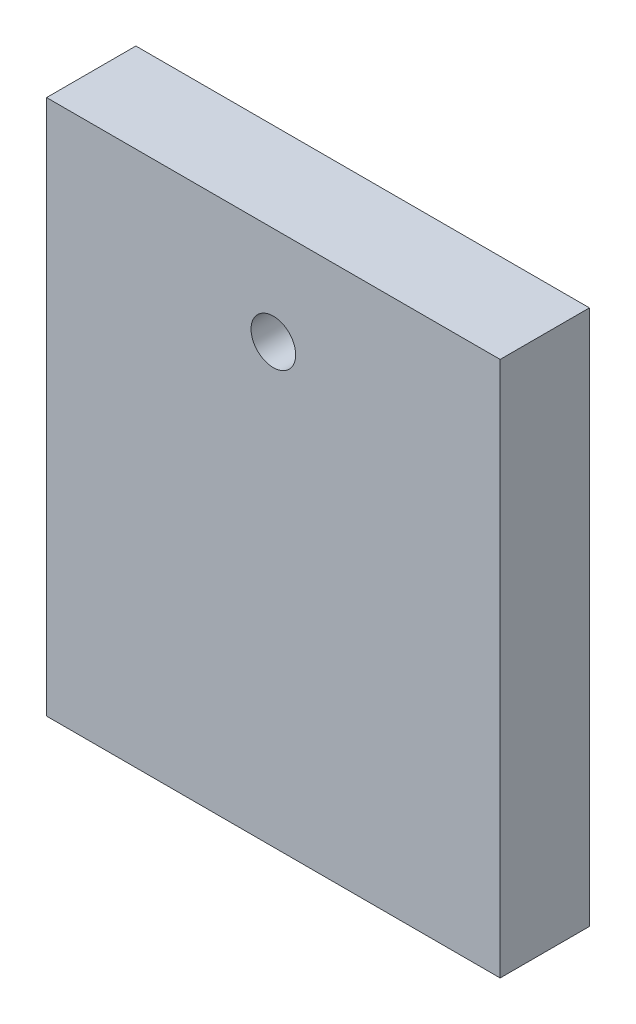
from build123d import *

# Parameters (mm, degrees)
SKETCH1_W           = 50.8
SKETCH1_H           = 60
SKETCH1_R           = 2.5
BOSS_EXTRUDE1_DEPTH = 10


with BuildPart() as part:
    # Sketch1 → Boss-Extrude1 (new body)
    with BuildSketch(Plane.XY):
        with Locations((25.4, 30)):
            Rectangle(SKETCH1_W, SKETCH1_H)
        with Locations((25.4, 49)):
            Circle(SKETCH1_R, mode=Mode.SUBTRACT)
    extrude(amount=BOSS_EXTRUDE1_DEPTH)


solid = part.part
